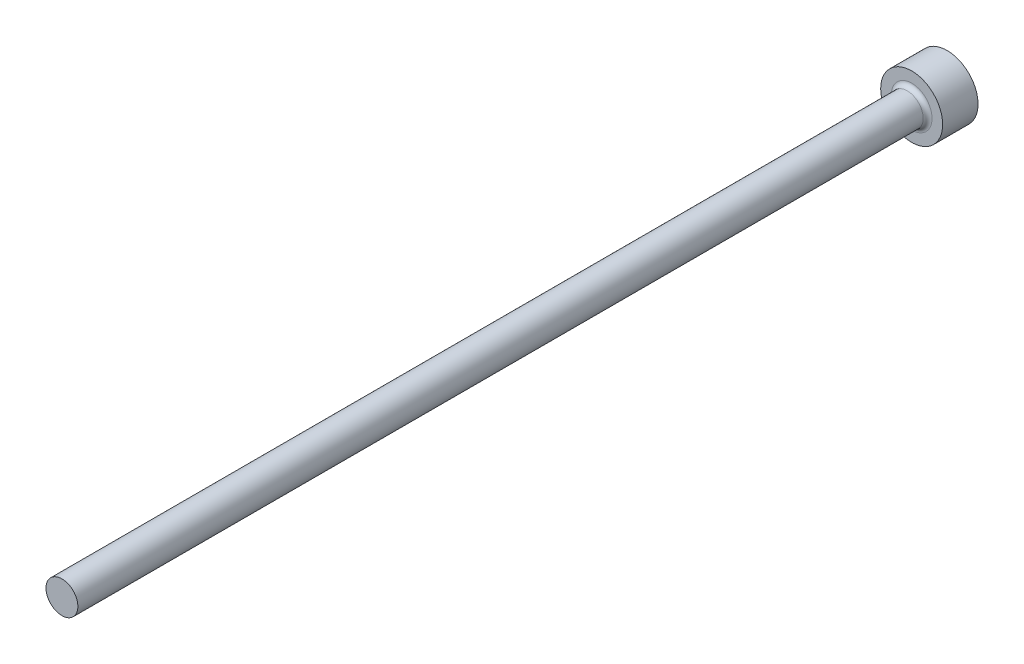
ISO-10303-21;
HEADER;
FILE_DESCRIPTION(('STEP AP214'),'2;1');
FILE_NAME('part.step','',(''),(''),'','','');
FILE_SCHEMA(('AUTOMOTIVE_DESIGN { 1 0 10303 214 1 1 1 1 }'));
ENDSEC;
DATA;
#1=APPLICATION_CONTEXT('core data for automotive mechanical design processes');
#2=APPLICATION_PROTOCOL_DEFINITION('international standard','automotive_design',2000,#1);
#3=PRODUCT_CONTEXT('',#1,'mechanical');
#4=PRODUCT('Part','Part','',(#3));
#5=PRODUCT_RELATED_PRODUCT_CATEGORY('part','',(#4));
#6=PRODUCT_DEFINITION_FORMATION('','',#4);
#7=PRODUCT_DEFINITION_CONTEXT('part definition',#1,'design');
#8=PRODUCT_DEFINITION('design','',#6,#7);
#9=PRODUCT_DEFINITION_SHAPE('','',#8);
#10=(LENGTH_UNIT() NAMED_UNIT(*) SI_UNIT(.MILLI.,.METRE.));
#11=(NAMED_UNIT(*) PLANE_ANGLE_UNIT() SI_UNIT($,.RADIAN.));
#12=(NAMED_UNIT(*) SI_UNIT($,.STERADIAN.) SOLID_ANGLE_UNIT());
#13=UNCERTAINTY_MEASURE_WITH_UNIT(LENGTH_MEASURE(1.E-05),#10,'distance_accuracy_value','');
#14=(GEOMETRIC_REPRESENTATION_CONTEXT(3) GLOBAL_UNCERTAINTY_ASSIGNED_CONTEXT((#13)) GLOBAL_UNIT_ASSIGNED_CONTEXT((#10,
#11,#12)) REPRESENTATION_CONTEXT('',''));
#15=CARTESIAN_POINT('',(0.,0.,0.));
#16=DIRECTION('',(0.,0.,1.));
#17=DIRECTION('',(1.,0.,0.));
#18=AXIS2_PLACEMENT_3D('',#15,#16,#17);
#19=CARTESIAN_POINT('',(3.5,0.,4.));
#20=DIRECTION('',(0.,0.,-1.));
#21=DIRECTION('',(-1.,0.,0.));
#22=AXIS2_PLACEMENT_3D('',#19,#20,#21);
#23=PLANE('',#22);
#24=CARTESIAN_POINT('',(0.,0.,4.));
#25=DIRECTION('',(0.,0.,-1.));
#26=DIRECTION('',(-1.,0.,0.));
#27=AXIS2_PLACEMENT_3D('',#24,#25,#26);
#28=CIRCLE('',#27,2.30000000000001);
#29=CARTESIAN_POINT('',(-2.30000000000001,0.,4.));
#30=VERTEX_POINT('',#29);
#31=EDGE_CURVE('E40',#30,#30,#28,.T.);
#32=ORIENTED_EDGE('',*,*,#31,.T.);
#33=EDGE_LOOP('',(#32));
#34=FACE_BOUND('',#33,.T.);
#35=CARTESIAN_POINT('',(0.,0.,4.));
#36=DIRECTION('',(0.,0.,-1.));
#37=DIRECTION('',(-1.,0.,0.));
#38=AXIS2_PLACEMENT_3D('',#35,#36,#37);
#39=CIRCLE('',#38,3.5);
#40=CARTESIAN_POINT('',(-3.5,0.,4.));
#41=VERTEX_POINT('',#40);
#42=EDGE_CURVE('E44',#41,#41,#39,.T.);
#43=ORIENTED_EDGE('',*,*,#42,.F.);
#44=EDGE_LOOP('',(#43));
#45=FACE_BOUND('',#44,.T.);
#46=ADVANCED_FACE('F33',(#34,#45),#23,.F.);
#47=CARTESIAN_POINT('',(0.,0.,-9.03322817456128));
#48=DIRECTION('',(0.,0.,-1.));
#49=DIRECTION('',(-1.,0.,0.));
#50=AXIS2_PLACEMENT_3D('',#47,#48,#49);
#51=CYLINDRICAL_SURFACE('',#50,3.5);
#52=CARTESIAN_POINT('',(0.,0.,0.));
#53=DIRECTION('',(0.,0.,-1.));
#54=DIRECTION('',(-1.,0.,0.));
#55=AXIS2_PLACEMENT_3D('',#52,#53,#54);
#56=CIRCLE('',#55,3.5);
#57=CARTESIAN_POINT('',(-3.5,0.,0.));
#58=VERTEX_POINT('',#57);
#59=EDGE_CURVE('E48',#58,#58,#56,.T.);
#60=ORIENTED_EDGE('',*,*,#59,.F.);
#61=EDGE_LOOP('',(#60));
#62=FACE_BOUND('',#61,.T.);
#63=ORIENTED_EDGE('',*,*,#42,.T.);
#64=EDGE_LOOP('',(#63));
#65=FACE_BOUND('',#64,.T.);
#66=ADVANCED_FACE('F68',(#62,#65),#51,.T.);
#67=CARTESIAN_POINT('',(0.,0.,0.));
#68=DIRECTION('',(0.,0.,1.));
#69=DIRECTION('',(1.,0.,0.));
#70=AXIS2_PLACEMENT_3D('',#67,#68,#69);
#71=PLANE('',#70);
#72=ORIENTED_EDGE('',*,*,#59,.T.);
#73=EDGE_LOOP('',(#72));
#74=FACE_BOUND('',#73,.T.);
#75=ADVANCED_FACE('F61',(#74),#71,.F.);
#76=CARTESIAN_POINT('',(0.,0.,100.));
#77=DIRECTION('',(0.,0.,-1.));
#78=DIRECTION('',(-1.,0.,0.));
#79=AXIS2_PLACEMENT_3D('',#76,#77,#78);
#80=PLANE('',#79);
#81=CARTESIAN_POINT('',(0.,0.,100.));
#82=DIRECTION('',(0.,0.,-1.));
#83=DIRECTION('',(-1.,0.,0.));
#84=AXIS2_PLACEMENT_3D('',#81,#82,#83);
#85=CIRCLE('',#84,1.80000000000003);
#86=CARTESIAN_POINT('',(-1.80000000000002,0.,100.));
#87=VERTEX_POINT('',#86);
#88=EDGE_CURVE('E53',#87,#87,#85,.T.);
#89=ORIENTED_EDGE('',*,*,#88,.F.);
#90=EDGE_LOOP('',(#89));
#91=FACE_BOUND('',#90,.T.);
#92=ADVANCED_FACE('F59',(#91),#80,.F.);
#93=CARTESIAN_POINT('',(0.,0.,-9.03322817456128));
#94=DIRECTION('',(0.,0.,-1.));
#95=DIRECTION('',(-1.,0.,0.));
#96=AXIS2_PLACEMENT_3D('',#93,#94,#95);
#97=CYLINDRICAL_SURFACE('',#96,1.80000000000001);
#98=CARTESIAN_POINT('',(0.,0.,4.5));
#99=DIRECTION('',(0.,0.,-1.));
#100=DIRECTION('',(-1.,0.,0.));
#101=AXIS2_PLACEMENT_3D('',#98,#99,#100);
#102=CIRCLE('',#101,1.80000000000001);
#103=CARTESIAN_POINT('',(-1.80000000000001,0.,4.5));
#104=VERTEX_POINT('',#103);
#105=EDGE_CURVE('E10',#104,#104,#102,.F.);
#106=ORIENTED_EDGE('',*,*,#105,.T.);
#107=EDGE_LOOP('',(#106));
#108=FACE_BOUND('',#107,.T.);
#109=ORIENTED_EDGE('',*,*,#88,.T.);
#110=EDGE_LOOP('',(#109));
#111=FACE_BOUND('',#110,.T.);
#112=ADVANCED_FACE('F57',(#108,#111),#97,.T.);
#113=CARTESIAN_POINT('',(0.,0.,4.5));
#114=DIRECTION('',(0.,0.,-1.));
#115=DIRECTION('',(-1.,0.,0.));
#116=AXIS2_PLACEMENT_3D('',#113,#114,#115);
#117=TOROIDAL_SURFACE('',#116,2.30000000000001,0.5);
#118=ORIENTED_EDGE('',*,*,#105,.F.);
#119=EDGE_LOOP('',(#118));
#120=FACE_BOUND('',#119,.T.);
#121=ORIENTED_EDGE('',*,*,#31,.F.);
#122=EDGE_LOOP('',(#121));
#123=FACE_BOUND('',#122,.T.);
#124=ADVANCED_FACE('F35',(#120,#123),#117,.F.);
#125=CLOSED_SHELL('',(#46,#66,#75,#92,#112,#124));
#126=MANIFOLD_SOLID_BREP('B2',#125);
#127=ADVANCED_BREP_SHAPE_REPRESENTATION('',(#18,#126),#14);
#128=SHAPE_DEFINITION_REPRESENTATION(#9,#127);
ENDSEC;
END-ISO-10303-21;
